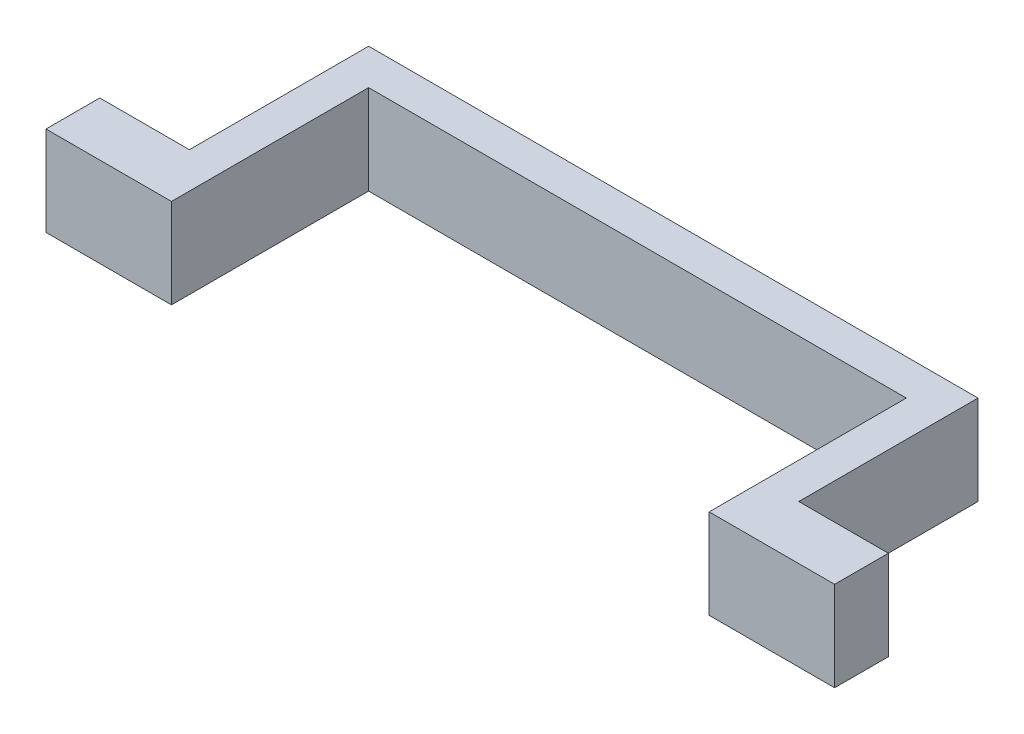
from build123d import *

# Parameters (mm, degrees)
CROQUIS1_W              = 34
CROQUIS1_H              = 5
SALIENTE_EXTRUIR1_DEPTH = 2
CROQUIS2_W              = 2
CROQUIS2_H              = 5
SALIENTE_EXTRUIR2_DEPTH = 11
CROQUIS3_W              = 5
CROQUIS3_H              = 5
SALIENTE_EXTRUIR3_DEPTH = 3


with BuildPart() as part:
    # Croquis1 → Saliente-Extruir1 (new body)
    with BuildSketch(Plane.XY):
        with Locations((28.397329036, -6.010845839)):
            Rectangle(CROQUIS1_W, CROQUIS1_H)
    extrude(amount=SALIENTE_EXTRUIR1_DEPTH)

    # Croquis2 → Saliente-Extruir2 (add)
    with BuildSketch(Plane.XY.offset(2)):
        with Locations((12.397329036, -6.010845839)):
            Rectangle(CROQUIS2_W, CROQUIS2_H)
        with Locations((44.397329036, -6.010845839)):
            Rectangle(CROQUIS2_W, CROQUIS2_H)
    extrude(amount=SALIENTE_EXTRUIR2_DEPTH)

    # Croquis3 → Saliente-Extruir3 (add)
    with BuildSketch(Plane.XY.offset(13)):
        with Locations((8.897329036, -6.010845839)):
            Rectangle(CROQUIS3_W, CROQUIS3_H)
        with Locations((47.897329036, -6.010845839)):
            Rectangle(CROQUIS3_W, CROQUIS3_H)
    extrude(amount=-SALIENTE_EXTRUIR3_DEPTH)


solid = part.part
